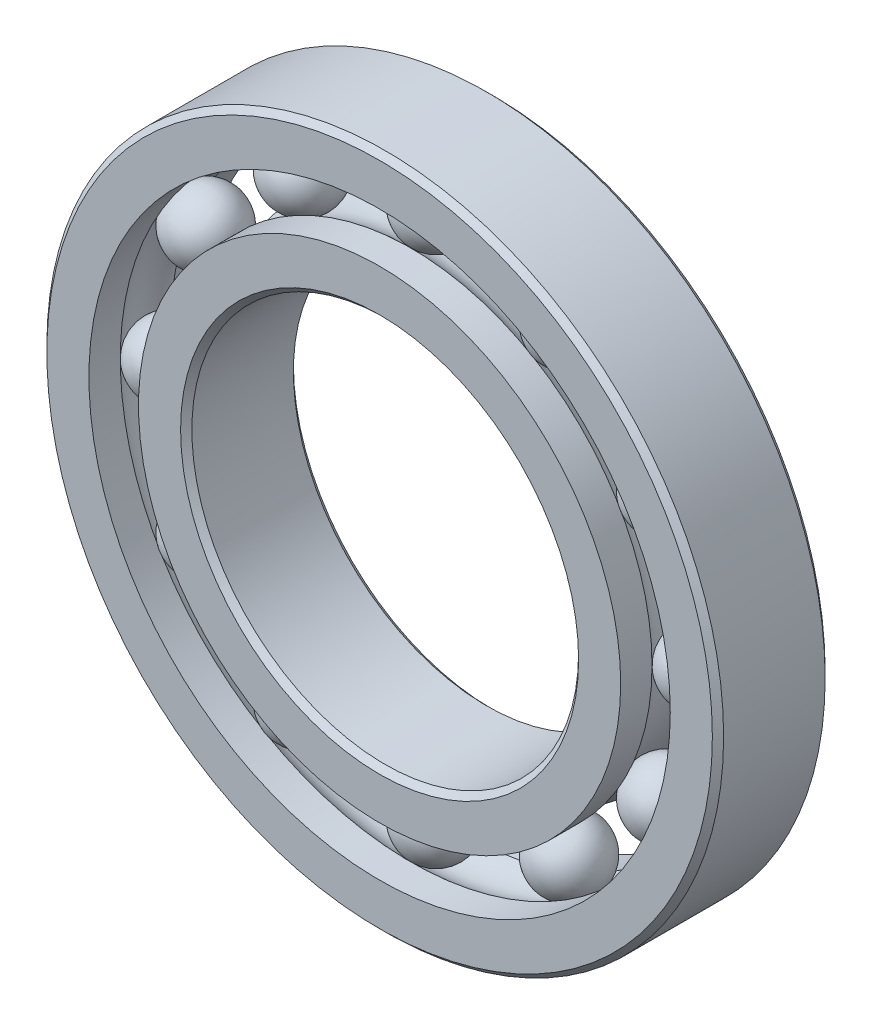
ISO-10303-21;
HEADER;
FILE_DESCRIPTION(('STEP AP214'),'2;1');
FILE_NAME('part.step','',(''),(''),'','','');
FILE_SCHEMA(('AUTOMOTIVE_DESIGN { 1 0 10303 214 1 1 1 1 }'));
ENDSEC;
DATA;
#1=APPLICATION_CONTEXT('core data for automotive mechanical design processes');
#2=APPLICATION_PROTOCOL_DEFINITION('international standard','automotive_design',2000,#1);
#3=PRODUCT_CONTEXT('',#1,'mechanical');
#4=PRODUCT('Part','Part','',(#3));
#5=PRODUCT_RELATED_PRODUCT_CATEGORY('part','',(#4));
#6=PRODUCT_DEFINITION_FORMATION('','',#4);
#7=PRODUCT_DEFINITION_CONTEXT('part definition',#1,'design');
#8=PRODUCT_DEFINITION('design','',#6,#7);
#9=PRODUCT_DEFINITION_SHAPE('','',#8);
#10=(LENGTH_UNIT() NAMED_UNIT(*) SI_UNIT(.MILLI.,.METRE.));
#11=(NAMED_UNIT(*) PLANE_ANGLE_UNIT() SI_UNIT($,.RADIAN.));
#12=(NAMED_UNIT(*) SI_UNIT($,.STERADIAN.) SOLID_ANGLE_UNIT());
#13=UNCERTAINTY_MEASURE_WITH_UNIT(LENGTH_MEASURE(1.E-05),#10,'distance_accuracy_value','');
#14=(GEOMETRIC_REPRESENTATION_CONTEXT(3) GLOBAL_UNCERTAINTY_ASSIGNED_CONTEXT((#13)) GLOBAL_UNIT_ASSIGNED_CONTEXT((#10,
#11,#12)) REPRESENTATION_CONTEXT('',''));
#15=CARTESIAN_POINT('',(0.,0.,0.));
#16=DIRECTION('',(0.,0.,1.));
#17=DIRECTION('',(1.,0.,0.));
#18=AXIS2_PLACEMENT_3D('',#15,#16,#17);
#19=CARTESIAN_POINT('',(-13.0968749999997,22.6844529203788,0.));
#20=DIRECTION('',(0.,0.,1.));
#21=DIRECTION('',(-0.499999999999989,0.866025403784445,0.));
#22=AXIS2_PLACEMENT_3D('',#19,#20,#21);
#23=SPHERICAL_SURFACE('',#22,3.47318625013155);
#24=CARTESIAN_POINT('',(-13.0968749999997,22.6844529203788,3.47318625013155));
#25=VERTEX_POINT('',#24);
#26=VERTEX_LOOP('',#25);
#27=FACE_BOUND('',#26,.T.);
#28=ADVANCED_FACE('F39',(#27),#23,.T.);
#29=CLOSED_SHELL('',(#28));
#30=MANIFOLD_SOLID_BREP('B2',#29);
#31=CARTESIAN_POINT('',(-22.6844529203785,13.0968750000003,0.));
#32=DIRECTION('',(0.,0.,1.));
#33=DIRECTION('',(-0.866025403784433,0.50000000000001,0.));
#34=AXIS2_PLACEMENT_3D('',#31,#32,#33);
#35=SPHERICAL_SURFACE('',#34,3.47318625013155);
#36=CARTESIAN_POINT('',(-22.6844529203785,13.0968750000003,3.47318625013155));
#37=VERTEX_POINT('',#36);
#38=VERTEX_LOOP('',#37);
#39=FACE_BOUND('',#38,.T.);
#40=ADVANCED_FACE('F59',(#39),#35,.T.);
#41=CLOSED_SHELL('',(#40));
#42=MANIFOLD_SOLID_BREP('B6',#41);
#43=CARTESIAN_POINT('',(-26.19375,2.74365126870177E-13,0.));
#44=DIRECTION('',(0.,0.,1.));
#45=DIRECTION('',(-1.,0.,0.));
#46=AXIS2_PLACEMENT_3D('',#43,#44,#45);
#47=SPHERICAL_SURFACE('',#46,3.47318625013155);
#48=CARTESIAN_POINT('',(-26.19375,2.74365126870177E-13,3.47318625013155));
#49=VERTEX_POINT('',#48);
#50=VERTEX_LOOP('',#49);
#51=FACE_BOUND('',#50,.T.);
#52=ADVANCED_FACE('F79',(#51),#47,.T.);
#53=CLOSED_SHELL('',(#52));
#54=MANIFOLD_SOLID_BREP('B35',#53);
#55=CARTESIAN_POINT('',(-22.6844529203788,-13.0968749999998,0.));
#56=DIRECTION('',(0.,0.,1.));
#57=DIRECTION('',(-0.866025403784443,-0.499999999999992,0.));
#58=AXIS2_PLACEMENT_3D('',#55,#56,#57);
#59=SPHERICAL_SURFACE('',#58,3.47318625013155);
#60=CARTESIAN_POINT('',(-22.6844529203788,-13.0968749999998,3.47318625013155));
#61=VERTEX_POINT('',#60);
#62=VERTEX_LOOP('',#61);
#63=FACE_BOUND('',#62,.T.);
#64=ADVANCED_FACE('F99',(#63),#59,.T.);
#65=CLOSED_SHELL('',(#64));
#66=MANIFOLD_SOLID_BREP('B55',#65);
#67=CARTESIAN_POINT('',(-13.0968750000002,-22.6844529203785,0.));
#68=DIRECTION('',(0.,0.,1.));
#69=DIRECTION('',(-0.500000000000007,-0.866025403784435,0.));
#70=AXIS2_PLACEMENT_3D('',#67,#68,#69);
#71=SPHERICAL_SURFACE('',#70,3.47318625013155);
#72=CARTESIAN_POINT('',(-13.0968750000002,-22.6844529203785,3.47318625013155));
#73=VERTEX_POINT('',#72);
#74=VERTEX_LOOP('',#73);
#75=FACE_BOUND('',#74,.T.);
#76=ADVANCED_FACE('F119',(#75),#71,.T.);
#77=CLOSED_SHELL('',(#76));
#78=MANIFOLD_SOLID_BREP('B75',#77);
#79=CARTESIAN_POINT('',(-1.82910084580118E-13,-26.19375,0.));
#80=DIRECTION('',(0.,0.,1.));
#81=DIRECTION('',(0.,-1.,0.));
#82=AXIS2_PLACEMENT_3D('',#79,#80,#81);
#83=SPHERICAL_SURFACE('',#82,3.47318625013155);
#84=CARTESIAN_POINT('',(-1.82910084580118E-13,-26.19375,3.47318625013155));
#85=VERTEX_POINT('',#84);
#86=VERTEX_LOOP('',#85);
#87=FACE_BOUND('',#86,.T.);
#88=ADVANCED_FACE('F139',(#87),#83,.T.);
#89=CLOSED_SHELL('',(#88));
#90=MANIFOLD_SOLID_BREP('B95',#89);
#91=CARTESIAN_POINT('',(13.0968749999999,-22.6844529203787,0.));
#92=DIRECTION('',(0.,0.,1.));
#93=DIRECTION('',(0.499999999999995,-0.866025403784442,0.));
#94=AXIS2_PLACEMENT_3D('',#91,#92,#93);
#95=SPHERICAL_SURFACE('',#94,3.47318625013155);
#96=CARTESIAN_POINT('',(13.0968749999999,-22.6844529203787,3.47318625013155));
#97=VERTEX_POINT('',#96);
#98=VERTEX_LOOP('',#97);
#99=FACE_BOUND('',#98,.T.);
#100=ADVANCED_FACE('F159',(#99),#95,.T.);
#101=CLOSED_SHELL('',(#100));
#102=MANIFOLD_SOLID_BREP('B115',#101);
#103=CARTESIAN_POINT('',(22.6844529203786,-13.0968750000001,0.));
#104=DIRECTION('',(0.,0.,1.));
#105=DIRECTION('',(0.866025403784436,-0.500000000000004,0.));
#106=AXIS2_PLACEMENT_3D('',#103,#104,#105);
#107=SPHERICAL_SURFACE('',#106,3.47318625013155);
#108=CARTESIAN_POINT('',(22.6844529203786,-13.0968750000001,3.47318625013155));
#109=VERTEX_POINT('',#108);
#110=VERTEX_LOOP('',#109);
#111=FACE_BOUND('',#110,.T.);
#112=ADVANCED_FACE('F179',(#111),#107,.T.);
#113=CLOSED_SHELL('',(#112));
#114=MANIFOLD_SOLID_BREP('B135',#113);
#115=CARTESIAN_POINT('',(26.19375,0.,0.));
#116=DIRECTION('',(0.,0.,1.));
#117=DIRECTION('',(1.,0.,0.));
#118=AXIS2_PLACEMENT_3D('',#115,#116,#117);
#119=SPHERICAL_SURFACE('',#118,3.47318625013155);
#120=CARTESIAN_POINT('',(26.19375,0.,3.47318625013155));
#121=VERTEX_POINT('',#120);
#122=VERTEX_LOOP('',#121);
#123=FACE_BOUND('',#122,.T.);
#124=ADVANCED_FACE('F199',(#123),#119,.T.);
#125=CLOSED_SHELL('',(#124));
#126=MANIFOLD_SOLID_BREP('B155',#125);
#127=CARTESIAN_POINT('',(22.6844529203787,13.0968749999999,0.));
#128=DIRECTION('',(0.,0.,1.));
#129=DIRECTION('',(0.86602540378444,0.499999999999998,0.));
#130=AXIS2_PLACEMENT_3D('',#127,#128,#129);
#131=SPHERICAL_SURFACE('',#130,3.47318625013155);
#132=CARTESIAN_POINT('',(22.6844529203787,13.0968749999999,3.47318625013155));
#133=VERTEX_POINT('',#132);
#134=VERTEX_LOOP('',#133);
#135=FACE_BOUND('',#134,.T.);
#136=ADVANCED_FACE('F219',(#135),#131,.T.);
#137=CLOSED_SHELL('',(#136));
#138=MANIFOLD_SOLID_BREP('B175',#137);
#139=CARTESIAN_POINT('',(13.096875,22.6844529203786,0.));
#140=DIRECTION('',(0.,0.,1.));
#141=DIRECTION('',(0.500000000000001,0.866025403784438,0.));
#142=AXIS2_PLACEMENT_3D('',#139,#140,#141);
#143=SPHERICAL_SURFACE('',#142,3.47318625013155);
#144=CARTESIAN_POINT('',(13.096875,22.6844529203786,3.47318625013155));
#145=VERTEX_POINT('',#144);
#146=VERTEX_LOOP('',#145);
#147=FACE_BOUND('',#146,.T.);
#148=ADVANCED_FACE('F239',(#147),#143,.T.);
#149=CLOSED_SHELL('',(#148));
#150=MANIFOLD_SOLID_BREP('B195',#149);
#151=CARTESIAN_POINT('',(0.,26.19375,0.));
#152=DIRECTION('',(0.,0.,1.));
#153=DIRECTION('',(0.,1.,0.));
#154=AXIS2_PLACEMENT_3D('',#151,#152,#153);
#155=SPHERICAL_SURFACE('',#154,3.47318625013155);
#156=CARTESIAN_POINT('',(0.,26.19375,3.47318625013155));
#157=VERTEX_POINT('',#156);
#158=VERTEX_LOOP('',#157);
#159=FACE_BOUND('',#158,.T.);
#160=ADVANCED_FACE('F261',(#159),#155,.T.);
#161=CLOSED_SHELL('',(#160));
#162=MANIFOLD_SOLID_BREP('B215',#161);
#163=CARTESIAN_POINT('',(0.,23.7514423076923,5.55625));
#164=DIRECTION('',(0.,0.,-1.));
#165=DIRECTION('',(-1.,0.,0.));
#166=AXIS2_PLACEMENT_3D('',#163,#164,#165);
#167=PLANE('',#166);
#168=CARTESIAN_POINT('',(0.,0.,5.55625));
#169=DIRECTION('',(0.,0.,1.));
#170=DIRECTION('',(1.,0.,0.));
#171=AXIS2_PLACEMENT_3D('',#168,#169,#170);
#172=CIRCLE('',#171,19.605625);
#173=CARTESIAN_POINT('',(19.605625,0.,5.55625));
#174=VERTEX_POINT('',#173);
#175=EDGE_CURVE('E308',#174,#174,#172,.T.);
#176=ORIENTED_EDGE('',*,*,#175,.F.);
#177=EDGE_LOOP('',(#176));
#178=FACE_BOUND('',#177,.T.);
#179=CARTESIAN_POINT('',(0.,0.,5.55625));
#180=DIRECTION('',(0.,0.,1.));
#181=DIRECTION('',(1.,0.,0.));
#182=AXIS2_PLACEMENT_3D('',#179,#180,#181);
#183=CIRCLE('',#182,23.7514423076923);
#184=CARTESIAN_POINT('',(23.7514423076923,0.,5.55625));
#185=VERTEX_POINT('',#184);
#186=EDGE_CURVE('E260',#185,#185,#183,.T.);
#187=ORIENTED_EDGE('',*,*,#186,.T.);
#188=EDGE_LOOP('',(#187));
#189=FACE_BOUND('',#188,.T.);
#190=ADVANCED_FACE('F280',(#178,#189),#167,.F.);
#191=CARTESIAN_POINT('',(0.,0.,5.55625));
#192=DIRECTION('',(0.,0.,1.));
#193=DIRECTION('',(1.,0.,0.));
#194=AXIS2_PLACEMENT_3D('',#191,#192,#193);
#195=CYLINDRICAL_SURFACE('',#194,23.7514423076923);
#196=ORIENTED_EDGE('',*,*,#186,.F.);
#197=EDGE_LOOP('',(#196));
#198=FACE_BOUND('',#197,.T.);
#199=CARTESIAN_POINT('',(0.,0.,2.46944444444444));
#200=DIRECTION('',(0.,0.,1.));
#201=DIRECTION('',(1.,0.,0.));
#202=AXIS2_PLACEMENT_3D('',#199,#200,#201);
#203=CIRCLE('',#202,23.7514423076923);
#204=CARTESIAN_POINT('',(23.7514423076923,0.,2.46944444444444));
#205=VERTEX_POINT('',#204);
#206=EDGE_CURVE('E286',#205,#205,#203,.T.);
#207=ORIENTED_EDGE('',*,*,#206,.T.);
#208=EDGE_LOOP('',(#207));
#209=FACE_BOUND('',#208,.T.);
#210=ADVANCED_FACE('F315',(#198,#209),#195,.T.);
#211=CARTESIAN_POINT('',(0.,0.,0.));
#212=DIRECTION('',(0.,0.,1.));
#213=DIRECTION('',(1.,0.,0.));
#214=AXIS2_PLACEMENT_3D('',#211,#212,#213);
#215=TOROIDAL_SURFACE('',#214,26.19375,3.47318625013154);
#216=ORIENTED_EDGE('',*,*,#206,.F.);
#217=EDGE_LOOP('',(#216));
#218=FACE_BOUND('',#217,.T.);
#219=CARTESIAN_POINT('',(0.,0.,-2.46944444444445));
#220=DIRECTION('',(0.,0.,1.));
#221=DIRECTION('',(1.,0.,0.));
#222=AXIS2_PLACEMENT_3D('',#219,#220,#221);
#223=CIRCLE('',#222,23.7514423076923);
#224=CARTESIAN_POINT('',(23.7514423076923,0.,-2.46944444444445));
#225=VERTEX_POINT('',#224);
#226=EDGE_CURVE('E290',#225,#225,#223,.T.);
#227=ORIENTED_EDGE('',*,*,#226,.T.);
#228=EDGE_LOOP('',(#227));
#229=FACE_BOUND('',#228,.T.);
#230=ADVANCED_FACE('F319',(#218,#229),#215,.F.);
#231=CARTESIAN_POINT('',(0.,0.,5.55625));
#232=DIRECTION('',(0.,0.,1.));
#233=DIRECTION('',(1.,0.,0.));
#234=AXIS2_PLACEMENT_3D('',#231,#232,#233);
#235=CYLINDRICAL_SURFACE('',#234,23.7514423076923);
#236=ORIENTED_EDGE('',*,*,#226,.F.);
#237=EDGE_LOOP('',(#236));
#238=FACE_BOUND('',#237,.T.);
#239=CARTESIAN_POINT('',(0.,0.,-5.55625));
#240=DIRECTION('',(0.,0.,1.));
#241=DIRECTION('',(1.,0.,0.));
#242=AXIS2_PLACEMENT_3D('',#239,#240,#241);
#243=CIRCLE('',#242,23.7514423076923);
#244=CARTESIAN_POINT('',(23.7514423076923,0.,-5.55625));
#245=VERTEX_POINT('',#244);
#246=EDGE_CURVE('E294',#245,#245,#243,.T.);
#247=ORIENTED_EDGE('',*,*,#246,.T.);
#248=EDGE_LOOP('',(#247));
#249=FACE_BOUND('',#248,.T.);
#250=ADVANCED_FACE('F324',(#238,#249),#235,.T.);
#251=CARTESIAN_POINT('',(0.,19.605625,-5.55625));
#252=DIRECTION('',(0.,0.,1.));
#253=DIRECTION('',(1.,0.,0.));
#254=AXIS2_PLACEMENT_3D('',#251,#252,#253);
#255=PLANE('',#254);
#256=ORIENTED_EDGE('',*,*,#246,.F.);
#257=EDGE_LOOP('',(#256));
#258=FACE_BOUND('',#257,.T.);
#259=CARTESIAN_POINT('',(0.,0.,-5.55625));
#260=DIRECTION('',(0.,0.,1.));
#261=DIRECTION('',(1.,0.,0.));
#262=AXIS2_PLACEMENT_3D('',#259,#260,#261);
#263=CIRCLE('',#262,19.605625);
#264=CARTESIAN_POINT('',(19.605625,0.,-5.55625));
#265=VERTEX_POINT('',#264);
#266=EDGE_CURVE('E299',#265,#265,#263,.T.);
#267=ORIENTED_EDGE('',*,*,#266,.T.);
#268=EDGE_LOOP('',(#267));
#269=FACE_BOUND('',#268,.T.);
#270=ADVANCED_FACE('F330',(#258,#269),#255,.F.);
#271=CARTESIAN_POINT('',(0.,0.,-5.000625));
#272=DIRECTION('',(0.,0.,-1.));
#273=DIRECTION('',(-1.,0.,0.));
#274=AXIS2_PLACEMENT_3D('',#271,#272,#273);
#275=CONICAL_SURFACE('',#274,19.05,0.785398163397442);
#276=ORIENTED_EDGE('',*,*,#266,.F.);
#277=EDGE_LOOP('',(#276));
#278=FACE_BOUND('',#277,.T.);
#279=CARTESIAN_POINT('',(0.,0.,-5.000625));
#280=DIRECTION('',(0.,0.,1.));
#281=DIRECTION('',(1.,0.,0.));
#282=AXIS2_PLACEMENT_3D('',#279,#280,#281);
#283=CIRCLE('',#282,19.05);
#284=CARTESIAN_POINT('',(19.05,0.,-5.000625));
#285=VERTEX_POINT('',#284);
#286=EDGE_CURVE('E302',#285,#285,#283,.T.);
#287=ORIENTED_EDGE('',*,*,#286,.T.);
#288=EDGE_LOOP('',(#287));
#289=FACE_BOUND('',#288,.T.);
#290=ADVANCED_FACE('F334',(#278,#289),#275,.F.);
#291=CARTESIAN_POINT('',(0.,0.,5.55625));
#292=DIRECTION('',(0.,0.,1.));
#293=DIRECTION('',(1.,0.,0.));
#294=AXIS2_PLACEMENT_3D('',#291,#292,#293);
#295=CYLINDRICAL_SURFACE('',#294,19.05);
#296=ORIENTED_EDGE('',*,*,#286,.F.);
#297=EDGE_LOOP('',(#296));
#298=FACE_BOUND('',#297,.T.);
#299=CARTESIAN_POINT('',(0.,0.,5.00062500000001));
#300=DIRECTION('',(0.,0.,1.));
#301=DIRECTION('',(1.,0.,0.));
#302=AXIS2_PLACEMENT_3D('',#299,#300,#301);
#303=CIRCLE('',#302,19.05);
#304=CARTESIAN_POINT('',(19.05,0.,5.00062500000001));
#305=VERTEX_POINT('',#304);
#306=EDGE_CURVE('E305',#305,#305,#303,.T.);
#307=ORIENTED_EDGE('',*,*,#306,.T.);
#308=EDGE_LOOP('',(#307));
#309=FACE_BOUND('',#308,.T.);
#310=ADVANCED_FACE('F338',(#298,#309),#295,.F.);
#311=CARTESIAN_POINT('',(0.,0.,5.55625));
#312=DIRECTION('',(0.,0.,1.));
#313=DIRECTION('',(1.,0.,0.));
#314=AXIS2_PLACEMENT_3D('',#311,#312,#313);
#315=CONICAL_SURFACE('',#314,19.605625,0.785398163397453);
#316=ORIENTED_EDGE('',*,*,#306,.F.);
#317=EDGE_LOOP('',(#316));
#318=FACE_BOUND('',#317,.T.);
#319=ORIENTED_EDGE('',*,*,#175,.T.);
#320=EDGE_LOOP('',(#319));
#321=FACE_BOUND('',#320,.T.);
#322=ADVANCED_FACE('F312',(#318,#321),#315,.F.);
#323=CLOSED_SHELL('',(#190,#210,#230,#250,#270,#290,#310,#322));
#324=MANIFOLD_SOLID_BREP('B235',#323);
#325=CARTESIAN_POINT('',(0.,0.,5.000625));
#326=DIRECTION('',(0.,0.,-1.));
#327=DIRECTION('',(-1.,0.,0.));
#328=AXIS2_PLACEMENT_3D('',#325,#326,#327);
#329=CONICAL_SURFACE('',#328,33.3375,0.785398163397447);
#330=CARTESIAN_POINT('',(0.,0.,5.55625));
#331=DIRECTION('',(0.,0.,1.));
#332=DIRECTION('',(1.,0.,0.));
#333=AXIS2_PLACEMENT_3D('',#330,#331,#332);
#334=CIRCLE('',#333,32.781875);
#335=CARTESIAN_POINT('',(32.781875,0.,5.55625));
#336=VERTEX_POINT('',#335);
#337=EDGE_CURVE('E429',#336,#336,#334,.T.);
#338=ORIENTED_EDGE('',*,*,#337,.F.);
#339=EDGE_LOOP('',(#338));
#340=FACE_BOUND('',#339,.T.);
#341=CARTESIAN_POINT('',(0.,0.,5.000625));
#342=DIRECTION('',(0.,0.,1.));
#343=DIRECTION('',(1.,0.,0.));
#344=AXIS2_PLACEMENT_3D('',#341,#342,#343);
#345=CIRCLE('',#344,33.3375);
#346=CARTESIAN_POINT('',(33.3375,0.,5.000625));
#347=VERTEX_POINT('',#346);
#348=EDGE_CURVE('E279',#347,#347,#345,.T.);
#349=ORIENTED_EDGE('',*,*,#348,.T.);
#350=EDGE_LOOP('',(#349));
#351=FACE_BOUND('',#350,.T.);
#352=ADVANCED_FACE('F401',(#340,#351),#329,.T.);
#353=CARTESIAN_POINT('',(0.,0.,5.55625));
#354=DIRECTION('',(0.,0.,1.));
#355=DIRECTION('',(1.,0.,0.));
#356=AXIS2_PLACEMENT_3D('',#353,#354,#355);
#357=CYLINDRICAL_SURFACE('',#356,33.3375);
#358=ORIENTED_EDGE('',*,*,#348,.F.);
#359=EDGE_LOOP('',(#358));
#360=FACE_BOUND('',#359,.T.);
#361=CARTESIAN_POINT('',(0.,0.,-5.000625));
#362=DIRECTION('',(0.,0.,1.));
#363=DIRECTION('',(1.,0.,0.));
#364=AXIS2_PLACEMENT_3D('',#361,#362,#363);
#365=CIRCLE('',#364,33.3375);
#366=CARTESIAN_POINT('',(33.3375,0.,-5.000625));
#367=VERTEX_POINT('',#366);
#368=EDGE_CURVE('E407',#367,#367,#365,.T.);
#369=ORIENTED_EDGE('',*,*,#368,.T.);
#370=EDGE_LOOP('',(#369));
#371=FACE_BOUND('',#370,.T.);
#372=ADVANCED_FACE('F436',(#360,#371),#357,.T.);
#373=CARTESIAN_POINT('',(0.,0.,-5.55625));
#374=DIRECTION('',(0.,0.,1.));
#375=DIRECTION('',(1.,0.,0.));
#376=AXIS2_PLACEMENT_3D('',#373,#374,#375);
#377=CONICAL_SURFACE('',#376,32.781875,0.785398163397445);
#378=ORIENTED_EDGE('',*,*,#368,.F.);
#379=EDGE_LOOP('',(#378));
#380=FACE_BOUND('',#379,.T.);
#381=CARTESIAN_POINT('',(0.,0.,-5.55625));
#382=DIRECTION('',(0.,0.,1.));
#383=DIRECTION('',(1.,0.,0.));
#384=AXIS2_PLACEMENT_3D('',#381,#382,#383);
#385=CIRCLE('',#384,32.781875);
#386=CARTESIAN_POINT('',(32.781875,0.,-5.55625));
#387=VERTEX_POINT('',#386);
#388=EDGE_CURVE('E411',#387,#387,#385,.T.);
#389=ORIENTED_EDGE('',*,*,#388,.T.);
#390=EDGE_LOOP('',(#389));
#391=FACE_BOUND('',#390,.T.);
#392=ADVANCED_FACE('F440',(#380,#391),#377,.T.);
#393=CARTESIAN_POINT('',(0.,32.781875,-5.55625));
#394=DIRECTION('',(0.,0.,1.));
#395=DIRECTION('',(1.,0.,0.));
#396=AXIS2_PLACEMENT_3D('',#393,#394,#395);
#397=PLANE('',#396);
#398=ORIENTED_EDGE('',*,*,#388,.F.);
#399=EDGE_LOOP('',(#398));
#400=FACE_BOUND('',#399,.T.);
#401=CARTESIAN_POINT('',(0.,0.,-5.55625));
#402=DIRECTION('',(0.,0.,1.));
#403=DIRECTION('',(1.,0.,0.));
#404=AXIS2_PLACEMENT_3D('',#401,#402,#403);
#405=CIRCLE('',#404,28.6360576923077);
#406=CARTESIAN_POINT('',(28.6360576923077,0.,-5.55625));
#407=VERTEX_POINT('',#406);
#408=EDGE_CURVE('E415',#407,#407,#405,.T.);
#409=ORIENTED_EDGE('',*,*,#408,.T.);
#410=EDGE_LOOP('',(#409));
#411=FACE_BOUND('',#410,.T.);
#412=ADVANCED_FACE('F445',(#400,#411),#397,.F.);
#413=CARTESIAN_POINT('',(0.,0.,5.55625));
#414=DIRECTION('',(0.,0.,1.));
#415=DIRECTION('',(1.,0.,0.));
#416=AXIS2_PLACEMENT_3D('',#413,#414,#415);
#417=CYLINDRICAL_SURFACE('',#416,28.6360576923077);
#418=ORIENTED_EDGE('',*,*,#408,.F.);
#419=EDGE_LOOP('',(#418));
#420=FACE_BOUND('',#419,.T.);
#421=CARTESIAN_POINT('',(0.,0.,-2.46944444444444));
#422=DIRECTION('',(0.,0.,1.));
#423=DIRECTION('',(1.,0.,0.));
#424=AXIS2_PLACEMENT_3D('',#421,#422,#423);
#425=CIRCLE('',#424,28.6360576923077);
#426=CARTESIAN_POINT('',(28.6360576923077,0.,-2.46944444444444));
#427=VERTEX_POINT('',#426);
#428=EDGE_CURVE('E420',#427,#427,#425,.T.);
#429=ORIENTED_EDGE('',*,*,#428,.T.);
#430=EDGE_LOOP('',(#429));
#431=FACE_BOUND('',#430,.T.);
#432=ADVANCED_FACE('F451',(#420,#431),#417,.F.);
#433=CARTESIAN_POINT('',(0.,0.,0.));
#434=DIRECTION('',(0.,0.,1.));
#435=DIRECTION('',(1.,0.,0.));
#436=AXIS2_PLACEMENT_3D('',#433,#434,#435);
#437=TOROIDAL_SURFACE('',#436,26.19375,3.47318625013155);
#438=ORIENTED_EDGE('',*,*,#428,.F.);
#439=EDGE_LOOP('',(#438));
#440=FACE_BOUND('',#439,.T.);
#441=CARTESIAN_POINT('',(0.,0.,2.46944444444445));
#442=DIRECTION('',(0.,0.,1.));
#443=DIRECTION('',(1.,0.,0.));
#444=AXIS2_PLACEMENT_3D('',#441,#442,#443);
#445=CIRCLE('',#444,28.6360576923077);
#446=CARTESIAN_POINT('',(28.6360576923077,0.,2.46944444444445));
#447=VERTEX_POINT('',#446);
#448=EDGE_CURVE('E423',#447,#447,#445,.T.);
#449=ORIENTED_EDGE('',*,*,#448,.T.);
#450=EDGE_LOOP('',(#449));
#451=FACE_BOUND('',#450,.T.);
#452=ADVANCED_FACE('F455',(#440,#451),#437,.F.);
#453=CARTESIAN_POINT('',(0.,0.,5.55625));
#454=DIRECTION('',(0.,0.,1.));
#455=DIRECTION('',(1.,0.,0.));
#456=AXIS2_PLACEMENT_3D('',#453,#454,#455);
#457=CYLINDRICAL_SURFACE('',#456,28.6360576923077);
#458=ORIENTED_EDGE('',*,*,#448,.F.);
#459=EDGE_LOOP('',(#458));
#460=FACE_BOUND('',#459,.T.);
#461=CARTESIAN_POINT('',(0.,0.,5.55625));
#462=DIRECTION('',(0.,0.,1.));
#463=DIRECTION('',(1.,0.,0.));
#464=AXIS2_PLACEMENT_3D('',#461,#462,#463);
#465=CIRCLE('',#464,28.6360576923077);
#466=CARTESIAN_POINT('',(28.6360576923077,0.,5.55625));
#467=VERTEX_POINT('',#466);
#468=EDGE_CURVE('E426',#467,#467,#465,.T.);
#469=ORIENTED_EDGE('',*,*,#468,.T.);
#470=EDGE_LOOP('',(#469));
#471=FACE_BOUND('',#470,.T.);
#472=ADVANCED_FACE('F459',(#460,#471),#457,.F.);
#473=CARTESIAN_POINT('',(0.,32.781875,5.55625));
#474=DIRECTION('',(0.,0.,-1.));
#475=DIRECTION('',(-1.,0.,0.));
#476=AXIS2_PLACEMENT_3D('',#473,#474,#475);
#477=PLANE('',#476);
#478=ORIENTED_EDGE('',*,*,#468,.F.);
#479=EDGE_LOOP('',(#478));
#480=FACE_BOUND('',#479,.T.);
#481=ORIENTED_EDGE('',*,*,#337,.T.);
#482=EDGE_LOOP('',(#481));
#483=FACE_BOUND('',#482,.T.);
#484=ADVANCED_FACE('F433',(#480,#483),#477,.F.);
#485=CLOSED_SHELL('',(#352,#372,#392,#412,#432,#452,#472,#484));
#486=MANIFOLD_SOLID_BREP('B255',#485);
#487=ADVANCED_BREP_SHAPE_REPRESENTATION('',(#18,#30,#42,#54,#66,#78,#90,#102,#114,#126,#138,
#150,#162,#324,#486),#14);
#488=SHAPE_DEFINITION_REPRESENTATION(#9,#487);
ENDSEC;
END-ISO-10303-21;
